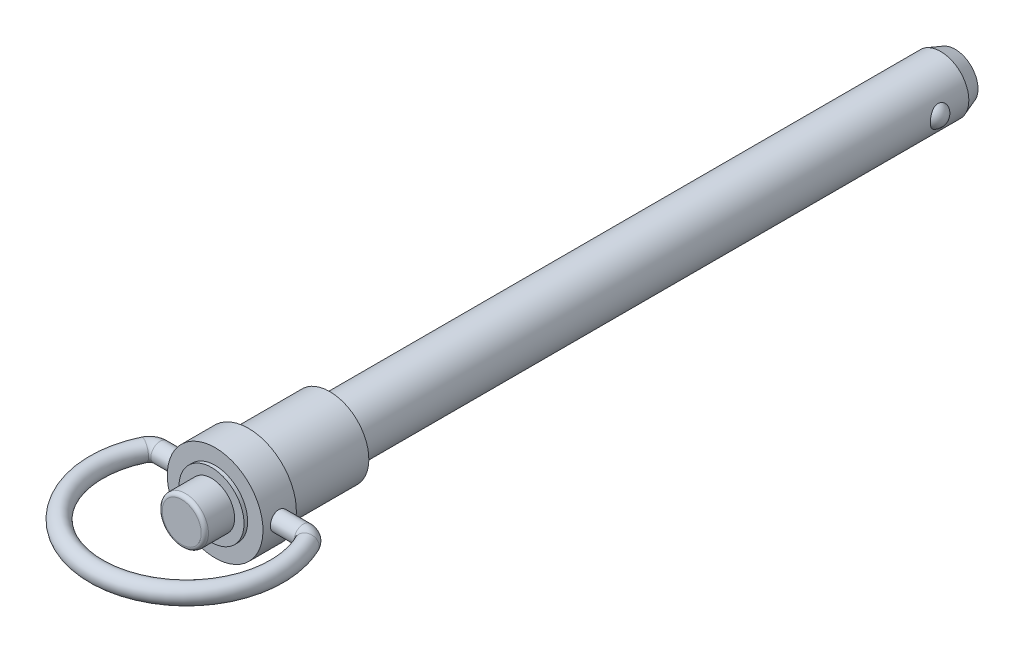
ISO-10303-21;
HEADER;
FILE_DESCRIPTION(('STEP AP214'),'2;1');
FILE_NAME('part.step','',(''),(''),'','','');
FILE_SCHEMA(('AUTOMOTIVE_DESIGN { 1 0 10303 214 1 1 1 1 }'));
ENDSEC;
DATA;
#1=APPLICATION_CONTEXT('core data for automotive mechanical design processes');
#2=APPLICATION_PROTOCOL_DEFINITION('international standard','automotive_design',2000,#1);
#3=PRODUCT_CONTEXT('',#1,'mechanical');
#4=PRODUCT('Part','Part','',(#3));
#5=PRODUCT_RELATED_PRODUCT_CATEGORY('part','',(#4));
#6=PRODUCT_DEFINITION_FORMATION('','',#4);
#7=PRODUCT_DEFINITION_CONTEXT('part definition',#1,'design');
#8=PRODUCT_DEFINITION('design','',#6,#7);
#9=PRODUCT_DEFINITION_SHAPE('','',#8);
#10=(LENGTH_UNIT() NAMED_UNIT(*) SI_UNIT(.MILLI.,.METRE.));
#11=(NAMED_UNIT(*) PLANE_ANGLE_UNIT() SI_UNIT($,.RADIAN.));
#12=(NAMED_UNIT(*) SI_UNIT($,.STERADIAN.) SOLID_ANGLE_UNIT());
#13=UNCERTAINTY_MEASURE_WITH_UNIT(LENGTH_MEASURE(1.E-05),#10,'distance_accuracy_value','');
#14=(GEOMETRIC_REPRESENTATION_CONTEXT(3) GLOBAL_UNCERTAINTY_ASSIGNED_CONTEXT((#13)) GLOBAL_UNIT_ASSIGNED_CONTEXT((#10,
#11,#12)) REPRESENTATION_CONTEXT('',''));
#15=CARTESIAN_POINT('',(0.,0.,0.));
#16=DIRECTION('',(0.,0.,1.));
#17=DIRECTION('',(1.,0.,0.));
#18=AXIS2_PLACEMENT_3D('',#15,#16,#17);
#19=CARTESIAN_POINT('',(0.,0.,20.828));
#20=DIRECTION('',(0.,0.,1.));
#21=DIRECTION('',(0.,-1.,0.));
#22=AXIS2_PLACEMENT_3D('',#19,#20,#21);
#23=PLANE('',#22);
#24=CARTESIAN_POINT('',(0.,0.,20.828));
#25=DIRECTION('',(0.,0.,-1.));
#26=DIRECTION('',(0.,1.,0.));
#27=AXIS2_PLACEMENT_3D('',#24,#25,#26);
#28=CIRCLE('',#27,2.7432);
#29=CARTESIAN_POINT('',(0.,2.7432,20.828));
#30=VERTEX_POINT('',#29);
#31=CARTESIAN_POINT('',(0.,-2.7432,20.828));
#32=VERTEX_POINT('',#31);
#33=EDGE_CURVE('E34',#30,#32,#28,.T.);
#34=ORIENTED_EDGE('',*,*,#33,.F.);
#35=CARTESIAN_POINT('',(0.,0.,20.828));
#36=DIRECTION('',(0.,0.,-1.));
#37=DIRECTION('',(0.,-1.,0.));
#38=AXIS2_PLACEMENT_3D('',#35,#36,#37);
#39=CIRCLE('',#38,2.7432);
#40=EDGE_CURVE('E29',#32,#30,#39,.T.);
#41=ORIENTED_EDGE('',*,*,#40,.F.);
#42=EDGE_LOOP('',(#34,#41));
#43=FACE_BOUND('',#42,.T.);
#44=ADVANCED_FACE('F15',(#43),#23,.T.);
#45=CARTESIAN_POINT('',(0.,0.,20.32));
#46=DIRECTION('',(0.,0.,1.));
#47=DIRECTION('',(0.,-1.,0.));
#48=AXIS2_PLACEMENT_3D('',#45,#46,#47);
#49=TOROIDAL_SURFACE('',#48,2.7432,0.508);
#50=ORIENTED_EDGE('',*,*,#40,.T.);
#51=ORIENTED_EDGE('',*,*,#33,.T.);
#52=EDGE_LOOP('',(#50,#51));
#53=FACE_BOUND('',#52,.T.);
#54=CARTESIAN_POINT('',(0.,0.,20.32));
#55=DIRECTION('',(0.,0.,-1.));
#56=DIRECTION('',(0.,1.,0.));
#57=AXIS2_PLACEMENT_3D('',#54,#55,#56);
#58=CIRCLE('',#57,3.2512);
#59=CARTESIAN_POINT('',(0.,3.2512,20.32));
#60=VERTEX_POINT('',#59);
#61=EDGE_CURVE('E51',#60,#60,#58,.T.);
#62=ORIENTED_EDGE('',*,*,#61,.F.);
#63=EDGE_LOOP('',(#62));
#64=FACE_BOUND('',#63,.T.);
#65=ADVANCED_FACE('F40',(#53,#64),#49,.T.);
#66=CARTESIAN_POINT('',(0.,0.,20.828));
#67=DIRECTION('',(0.,0.,-1.));
#68=DIRECTION('',(0.,1.,0.));
#69=AXIS2_PLACEMENT_3D('',#66,#67,#68);
#70=CYLINDRICAL_SURFACE('',#69,3.2512);
#71=CARTESIAN_POINT('',(0.,0.,16.637));
#72=DIRECTION('',(0.,0.,-1.));
#73=DIRECTION('',(0.,1.,0.));
#74=AXIS2_PLACEMENT_3D('',#71,#72,#73);
#75=CIRCLE('',#74,3.2512);
#76=CARTESIAN_POINT('',(0.,3.2512,16.637));
#77=VERTEX_POINT('',#76);
#78=EDGE_CURVE('E60',#77,#77,#75,.T.);
#79=ORIENTED_EDGE('',*,*,#78,.F.);
#80=EDGE_LOOP('',(#79));
#81=FACE_BOUND('',#80,.T.);
#82=ORIENTED_EDGE('',*,*,#61,.T.);
#83=EDGE_LOOP('',(#82));
#84=FACE_BOUND('',#83,.T.);
#85=ADVANCED_FACE('F80',(#81,#84),#70,.T.);
#86=CARTESIAN_POINT('',(4.572,0.,16.637));
#87=DIRECTION('',(0.,0.,1.));
#88=DIRECTION('',(0.,-1.,0.));
#89=AXIS2_PLACEMENT_3D('',#86,#87,#88);
#90=PLANE('',#89);
#91=ORIENTED_EDGE('',*,*,#78,.T.);
#92=EDGE_LOOP('',(#91));
#93=FACE_BOUND('',#92,.T.);
#94=CARTESIAN_POINT('',(0.,0.,16.637));
#95=DIRECTION('',(0.,0.,-1.));
#96=DIRECTION('',(0.,1.,0.));
#97=AXIS2_PLACEMENT_3D('',#94,#95,#96);
#98=CIRCLE('',#97,4.572);
#99=CARTESIAN_POINT('',(0.,4.572,16.637));
#100=VERTEX_POINT('',#99);
#101=EDGE_CURVE('E64',#100,#100,#98,.T.);
#102=ORIENTED_EDGE('',*,*,#101,.F.);
#103=EDGE_LOOP('',(#102));
#104=FACE_BOUND('',#103,.T.);
#105=ADVANCED_FACE('F83',(#93,#104),#90,.T.);
#106=CARTESIAN_POINT('',(0.,0.,0.));
#107=DIRECTION('',(0.,0.,-1.));
#108=DIRECTION('',(0.,1.,0.));
#109=AXIS2_PLACEMENT_3D('',#106,#107,#108);
#110=CYLINDRICAL_SURFACE('',#109,4.572);
#111=ORIENTED_EDGE('',*,*,#101,.T.);
#112=EDGE_LOOP('',(#111));
#113=FACE_BOUND('',#112,.T.);
#114=CARTESIAN_POINT('',(0.,0.,16.129));
#115=DIRECTION('',(0.,0.,-1.));
#116=DIRECTION('',(0.,1.,0.));
#117=AXIS2_PLACEMENT_3D('',#114,#115,#116);
#118=CIRCLE('',#117,4.572);
#119=CARTESIAN_POINT('',(0.,4.572,16.129));
#120=VERTEX_POINT('',#119);
#121=EDGE_CURVE('E218',#120,#120,#118,.T.);
#122=ORIENTED_EDGE('',*,*,#121,.F.);
#123=EDGE_LOOP('',(#122));
#124=FACE_BOUND('',#123,.T.);
#125=ADVANCED_FACE('F182',(#113,#124),#110,.T.);
#126=CARTESIAN_POINT('',(6.731,0.,16.129));
#127=DIRECTION('',(0.,0.,1.));
#128=DIRECTION('',(0.,-1.,0.));
#129=AXIS2_PLACEMENT_3D('',#126,#127,#128);
#130=PLANE('',#129);
#131=CARTESIAN_POINT('',(0.,0.,16.129));
#132=DIRECTION('',(0.,0.,-1.));
#133=DIRECTION('',(0.,1.,0.));
#134=AXIS2_PLACEMENT_3D('',#131,#132,#133);
#135=CIRCLE('',#134,6.731);
#136=CARTESIAN_POINT('',(0.,6.731,16.129));
#137=VERTEX_POINT('',#136);
#138=EDGE_CURVE('E221',#137,#137,#135,.T.);
#139=ORIENTED_EDGE('',*,*,#138,.F.);
#140=EDGE_LOOP('',(#139));
#141=FACE_BOUND('',#140,.T.);
#142=ORIENTED_EDGE('',*,*,#121,.T.);
#143=EDGE_LOOP('',(#142));
#144=FACE_BOUND('',#143,.T.);
#145=ADVANCED_FACE('F171',(#141,#144),#130,.T.);
#146=CARTESIAN_POINT('',(0.,0.,0.));
#147=DIRECTION('',(0.,0.,-1.));
#148=DIRECTION('',(0.,1.,0.));
#149=AXIS2_PLACEMENT_3D('',#146,#147,#148);
#150=CYLINDRICAL_SURFACE('',#149,6.731);
#151=CARTESIAN_POINT('',(0.,0.,11.43));
#152=DIRECTION('',(0.,0.,-1.));
#153=DIRECTION('',(0.,1.,0.));
#154=AXIS2_PLACEMENT_3D('',#151,#152,#153);
#155=CIRCLE('',#154,6.731);
#156=CARTESIAN_POINT('',(0.,6.731,11.43));
#157=VERTEX_POINT('',#156);
#158=EDGE_CURVE('E223',#157,#157,#155,.T.);
#159=ORIENTED_EDGE('',*,*,#158,.F.);
#160=EDGE_LOOP('',(#159));
#161=FACE_BOUND('',#160,.T.);
#162=ORIENTED_EDGE('',*,*,#138,.T.);
#163=EDGE_LOOP('',(#162));
#164=FACE_BOUND('',#163,.T.);
#165=CARTESIAN_POINT('',(-6.6051722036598,1.2954,13.7922));
#166=CARTESIAN_POINT('',(-6.60517361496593,1.2953972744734,13.864236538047));
#167=CARTESIAN_POINT('',(-6.60636346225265,1.28937073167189,13.9363080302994));
#168=CARTESIAN_POINT('',(-6.61098794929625,1.26544153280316,14.0784162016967));
#169=CARTESIAN_POINT('',(-6.61442445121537,1.24752902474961,14.1484511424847));
#170=CARTESIAN_POINT('',(-6.62313895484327,1.20040052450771,14.2844095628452));
#171=CARTESIAN_POINT('',(-6.62841519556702,1.17119533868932,14.3503369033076));
#172=CARTESIAN_POINT('',(-6.64021258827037,1.10233951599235,14.4763528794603));
#173=CARTESIAN_POINT('',(-6.64673365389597,1.06268960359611,14.5364419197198));
#174=CARTESIAN_POINT('',(-6.66038139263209,0.973516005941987,14.6498669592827));
#175=CARTESIAN_POINT('',(-6.66751428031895,0.9238817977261,14.7031153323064));
#176=CARTESIAN_POINT('',(-6.68152715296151,0.816387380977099,14.8005834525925));
#177=CARTESIAN_POINT('',(-6.6884071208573,0.758526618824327,14.8448025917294));
#178=CARTESIAN_POINT('',(-6.7012057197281,0.635644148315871,14.9232944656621));
#179=CARTESIAN_POINT('',(-6.70711617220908,0.570568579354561,14.9574843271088));
#180=CARTESIAN_POINT('',(-6.71724013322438,0.435464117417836,15.014412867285));
#181=CARTESIAN_POINT('',(-6.72145378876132,0.365435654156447,15.0371525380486));
#182=CARTESIAN_POINT('',(-6.72766549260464,0.223321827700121,15.0702635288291));
#183=CARTESIAN_POINT('',(-6.72968999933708,0.151272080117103,15.0807826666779));
#184=CARTESIAN_POINT('',(-6.73138656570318,0.00640388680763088,15.089614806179));
#185=CARTESIAN_POINT('',(-6.73105883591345,-0.0664144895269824,15.0879289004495));
#186=CARTESIAN_POINT('',(-6.72810846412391,-0.209738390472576,15.072511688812));
#187=CARTESIAN_POINT('',(-6.72551615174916,-0.280261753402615,15.0589395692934));
#188=CARTESIAN_POINT('',(-6.71836197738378,-0.418011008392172,15.0203872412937));
#189=CARTESIAN_POINT('',(-6.71380004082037,-0.485236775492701,14.9954066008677));
#190=CARTESIAN_POINT('',(-6.70316878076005,-0.614941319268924,14.9345963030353));
#191=CARTESIAN_POINT('',(-6.69709072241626,-0.67738974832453,14.8987035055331));
#192=CARTESIAN_POINT('',(-6.68409856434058,-0.795436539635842,14.8171343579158));
#193=CARTESIAN_POINT('',(-6.677184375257,-0.851034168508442,14.7714569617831));
#194=CARTESIAN_POINT('',(-6.66315320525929,-0.954744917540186,14.6707395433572));
#195=CARTESIAN_POINT('',(-6.65603475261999,-1.00272266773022,14.6155602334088));
#196=CARTESIAN_POINT('',(-6.64250376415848,-1.08876420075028,14.4978679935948));
#197=CARTESIAN_POINT('',(-6.63609123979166,-1.12682782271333,14.4353549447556));
#198=CARTESIAN_POINT('',(-6.62469571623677,-1.19200234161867,14.3045844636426));
#199=CARTESIAN_POINT('',(-6.61971540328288,-1.21909269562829,14.2363165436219));
#200=CARTESIAN_POINT('',(-6.61178862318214,-1.26138008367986,14.0960804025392));
#201=CARTESIAN_POINT('',(-6.60884191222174,-1.27657854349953,14.0241126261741));
#202=CARTESIAN_POINT('',(-6.60536444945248,-1.29445125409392,13.8797427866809));
#203=CARTESIAN_POINT('',(-6.60479610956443,-1.29732037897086,13.8073657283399));
#204=CARTESIAN_POINT('',(-6.60603903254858,-1.29097613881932,13.6631669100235));
#205=CARTESIAN_POINT('',(-6.60785017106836,-1.28176340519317,13.5913451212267));
#206=CARTESIAN_POINT('',(-6.6136128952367,-1.25168453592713,13.4509418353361));
#207=CARTESIAN_POINT('',(-6.61754556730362,-1.23092132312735,13.3823374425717));
#208=CARTESIAN_POINT('',(-6.62709183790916,-1.17844042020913,13.249581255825));
#209=CARTESIAN_POINT('',(-6.63270556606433,-1.14672188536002,13.1854298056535));
#210=CARTESIAN_POINT('',(-6.6450665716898,-1.07278507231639,13.0625442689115));
#211=CARTESIAN_POINT('',(-6.65182676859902,-1.03044414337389,13.0038853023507));
#212=CARTESIAN_POINT('',(-6.66568301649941,-0.936629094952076,12.8944341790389));
#213=CARTESIAN_POINT('',(-6.67277909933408,-0.885154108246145,12.8436427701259));
#214=CARTESIAN_POINT('',(-6.68662882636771,-0.773660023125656,12.7506362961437));
#215=CARTESIAN_POINT('',(-6.69337621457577,-0.713530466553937,12.7085525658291));
#216=CARTESIAN_POINT('',(-6.70566168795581,-0.586941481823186,12.6350847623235));
#217=CARTESIAN_POINT('',(-6.71119982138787,-0.520482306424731,12.6037002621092));
#218=CARTESIAN_POINT('',(-6.72041595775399,-0.383476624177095,12.5527164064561));
#219=CARTESIAN_POINT('',(-6.72410395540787,-0.312954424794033,12.5330536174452));
#220=CARTESIAN_POINT('',(-6.72924701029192,-0.169530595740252,12.5058694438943));
#221=CARTESIAN_POINT('',(-6.7307023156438,-0.0966292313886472,12.4983467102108));
#222=CARTESIAN_POINT('',(-6.73121071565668,0.0482259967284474,12.4957052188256));
#223=CARTESIAN_POINT('',(-6.73030215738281,0.120176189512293,12.5003884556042));
#224=CARTESIAN_POINT('',(-6.72626496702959,0.26224403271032,12.5215909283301));
#225=CARTESIAN_POINT('',(-6.72313635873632,0.332361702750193,12.5381100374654));
#226=CARTESIAN_POINT('',(-6.71501101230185,0.468662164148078,12.5824301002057));
#227=CARTESIAN_POINT('',(-6.710017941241,0.534852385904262,12.6102089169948));
#228=CARTESIAN_POINT('',(-6.69870305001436,0.661661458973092,12.6762356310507));
#229=CARTESIAN_POINT('',(-6.69238113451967,0.722279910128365,12.7144842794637));
#230=CARTESIAN_POINT('',(-6.6789853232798,0.837208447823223,12.8010411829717));
#231=CARTESIAN_POINT('',(-6.67190155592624,0.891410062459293,12.8494919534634));
#232=CARTESIAN_POINT('',(-6.65784127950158,0.990982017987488,12.95478313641));
#233=CARTESIAN_POINT('',(-6.65086479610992,1.03635027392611,13.0116255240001));
#234=CARTESIAN_POINT('',(-6.63773378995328,1.11738877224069,13.1327559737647));
#235=CARTESIAN_POINT('',(-6.63158802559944,1.15295925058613,13.1971117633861));
#236=CARTESIAN_POINT('',(-6.62092027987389,1.21272619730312,13.3309847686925));
#237=CARTESIAN_POINT('',(-6.61639678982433,1.23693323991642,13.4004971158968));
#238=CARTESIAN_POINT('',(-6.61041337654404,1.26845390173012,13.5238636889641));
#239=CARTESIAN_POINT('',(-6.60845980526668,1.27854107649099,13.57700269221));
#240=CARTESIAN_POINT('',(-6.60583870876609,1.29201504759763,13.6841545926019));
#241=CARTESIAN_POINT('',(-6.60517114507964,1.29540204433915,13.7381674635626));
#242=CARTESIAN_POINT('',(-6.6051722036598,1.2954,13.7922));
#243=B_SPLINE_CURVE_WITH_KNOTS('',3,(#165,#166,#167,#168,#169,#170,#171,#172,#173,#174,#175,
#176,#177,#178,#179,#180,#181,#182,#183,#184,#185,#186,#187,#188,#189,#190,#191,#192,#193,#194,
#195,#196,#197,#198,#199,#200,#201,#202,#203,#204,#205,#206,#207,#208,#209,#210,#211,#212,#213,
#214,#215,#216,#217,#218,#219,#220,#221,#222,#223,#224,#225,#226,#227,#228,#229,#230,#231,#232,
#233,#234,#235,#236,#237,#238,#239,#240,#241,#242),.UNSPECIFIED.,.T.,.F.,(4,2,2,2,2,2,2,2,2,2,2,
2,2,2,2,2,2,2,2,2,2,2,2,2,2,2,2,2,2,2,2,2,2,2,2,2,2,2,4),(0.,0.215911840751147,
0.432002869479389,0.64788762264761,0.86375740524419,1.08216318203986,1.30058366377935,
1.52076118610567,1.74091962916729,1.95838638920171,2.1758336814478,2.39041258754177,
2.60499961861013,2.82085272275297,3.0367289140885,3.25609136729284,3.47545737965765,
3.69523218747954,3.91498064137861,4.13124273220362,4.34749352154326,4.56184753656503,
4.7762180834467,4.99318797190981,5.21017847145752,5.430235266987,5.65028327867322,
5.86912939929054,6.08795119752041,6.30324544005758,6.51853737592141,6.73340808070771,
6.94829420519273,7.16640910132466,7.38457541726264,7.60488731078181,7.82499378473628,
7.9869478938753,8.14889715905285),.UNSPECIFIED.);
#244=CARTESIAN_POINT('',(-6.6051722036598,1.2954,13.7922));
#245=VERTEX_POINT('',#244);
#246=EDGE_CURVE('E192',#245,#245,#243,.T.);
#247=ORIENTED_EDGE('',*,*,#246,.T.);
#248=EDGE_LOOP('',(#247));
#249=FACE_BOUND('',#248,.T.);
#250=CARTESIAN_POINT('',(6.6051722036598,1.2954,13.7922));
#251=CARTESIAN_POINT('',(6.60517361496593,1.2953972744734,13.720163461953));
#252=CARTESIAN_POINT('',(6.60636346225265,1.2893707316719,13.6480919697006));
#253=CARTESIAN_POINT('',(6.61098794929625,1.26544153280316,13.5059837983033));
#254=CARTESIAN_POINT('',(6.61442445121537,1.24752902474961,13.4359488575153));
#255=CARTESIAN_POINT('',(6.62313895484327,1.20040052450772,13.2999904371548));
#256=CARTESIAN_POINT('',(6.62841519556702,1.17119533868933,13.2340630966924));
#257=CARTESIAN_POINT('',(6.64021258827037,1.10233951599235,13.1080471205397));
#258=CARTESIAN_POINT('',(6.64673365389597,1.06268960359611,13.0479580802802));
#259=CARTESIAN_POINT('',(6.66038139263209,0.973516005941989,12.9345330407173));
#260=CARTESIAN_POINT('',(6.66751428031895,0.923881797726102,12.8812846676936));
#261=CARTESIAN_POINT('',(6.68152715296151,0.816387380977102,12.7838165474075));
#262=CARTESIAN_POINT('',(6.6884071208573,0.758526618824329,12.7395974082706));
#263=CARTESIAN_POINT('',(6.7012057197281,0.635644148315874,12.6611055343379));
#264=CARTESIAN_POINT('',(6.70711617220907,0.570568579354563,12.6269156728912));
#265=CARTESIAN_POINT('',(6.71724013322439,0.435464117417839,12.569987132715));
#266=CARTESIAN_POINT('',(6.72145378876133,0.36543565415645,12.5472474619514));
#267=CARTESIAN_POINT('',(6.72766549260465,0.223321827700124,12.5141364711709));
#268=CARTESIAN_POINT('',(6.72968999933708,0.151272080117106,12.5036173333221));
#269=CARTESIAN_POINT('',(6.73138656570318,0.00640388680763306,12.494785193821));
#270=CARTESIAN_POINT('',(6.73105883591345,-0.0664144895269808,12.4964710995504));
#271=CARTESIAN_POINT('',(6.72810846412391,-0.209738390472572,12.511888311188));
#272=CARTESIAN_POINT('',(6.72551615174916,-0.280261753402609,12.5254604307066));
#273=CARTESIAN_POINT('',(6.71836197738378,-0.418011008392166,12.5640127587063));
#274=CARTESIAN_POINT('',(6.71380004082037,-0.4852367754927,12.5889933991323));
#275=CARTESIAN_POINT('',(6.70316878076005,-0.614941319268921,12.6498036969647));
#276=CARTESIAN_POINT('',(6.69709072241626,-0.67738974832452,12.6856964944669));
#277=CARTESIAN_POINT('',(6.68409856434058,-0.795436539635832,12.7672656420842));
#278=CARTESIAN_POINT('',(6.677184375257,-0.851034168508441,12.8129430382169));
#279=CARTESIAN_POINT('',(6.66315320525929,-0.954744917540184,12.9136604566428));
#280=CARTESIAN_POINT('',(6.65603475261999,-1.00272266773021,12.9688397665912));
#281=CARTESIAN_POINT('',(6.64250376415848,-1.08876420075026,13.0865320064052));
#282=CARTESIAN_POINT('',(6.63609123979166,-1.12682782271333,13.1490450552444));
#283=CARTESIAN_POINT('',(6.62469571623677,-1.19200234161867,13.2798155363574));
#284=CARTESIAN_POINT('',(6.61971540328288,-1.21909269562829,13.3480834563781));
#285=CARTESIAN_POINT('',(6.61178862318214,-1.26138008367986,13.4883195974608));
#286=CARTESIAN_POINT('',(6.60884191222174,-1.27657854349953,13.5602873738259));
#287=CARTESIAN_POINT('',(6.60536444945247,-1.29445125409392,13.7046572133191));
#288=CARTESIAN_POINT('',(6.60479610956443,-1.29732037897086,13.7770342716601));
#289=CARTESIAN_POINT('',(6.60603903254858,-1.29097613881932,13.9212330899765));
#290=CARTESIAN_POINT('',(6.60785017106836,-1.28176340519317,13.9930548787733));
#291=CARTESIAN_POINT('',(6.6136128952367,-1.25168453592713,14.1334581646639));
#292=CARTESIAN_POINT('',(6.61754556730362,-1.23092132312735,14.2020625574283));
#293=CARTESIAN_POINT('',(6.62709183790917,-1.17844042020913,14.334818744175));
#294=CARTESIAN_POINT('',(6.63270556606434,-1.14672188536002,14.3989701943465));
#295=CARTESIAN_POINT('',(6.64506657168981,-1.07278507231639,14.5218557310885));
#296=CARTESIAN_POINT('',(6.65182676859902,-1.03044414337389,14.5805146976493));
#297=CARTESIAN_POINT('',(6.66568301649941,-0.936629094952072,14.6899658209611));
#298=CARTESIAN_POINT('',(6.67277909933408,-0.885154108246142,14.7407572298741));
#299=CARTESIAN_POINT('',(6.68662882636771,-0.773660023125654,14.8337637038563));
#300=CARTESIAN_POINT('',(6.69337621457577,-0.713530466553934,14.8758474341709));
#301=CARTESIAN_POINT('',(6.70566168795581,-0.586941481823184,14.9493152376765));
#302=CARTESIAN_POINT('',(6.71119982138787,-0.520482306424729,14.9806997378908));
#303=CARTESIAN_POINT('',(6.72041595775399,-0.383476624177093,15.0316835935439));
#304=CARTESIAN_POINT('',(6.72410395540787,-0.31295442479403,15.0513463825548));
#305=CARTESIAN_POINT('',(6.72924701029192,-0.169530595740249,15.0785305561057));
#306=CARTESIAN_POINT('',(6.7307023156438,-0.0966292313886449,15.0860532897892));
#307=CARTESIAN_POINT('',(6.73121071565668,0.0482259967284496,15.0886947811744));
#308=CARTESIAN_POINT('',(6.73030215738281,0.120176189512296,15.0840115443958));
#309=CARTESIAN_POINT('',(6.72626496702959,0.262244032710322,15.0628090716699));
#310=CARTESIAN_POINT('',(6.72313635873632,0.332361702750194,15.0462899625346));
#311=CARTESIAN_POINT('',(6.71501101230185,0.46866216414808,15.0019698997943));
#312=CARTESIAN_POINT('',(6.710017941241,0.534852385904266,14.9741910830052));
#313=CARTESIAN_POINT('',(6.69870305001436,0.661661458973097,14.9081643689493));
#314=CARTESIAN_POINT('',(6.69238113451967,0.722279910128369,14.8699157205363));
#315=CARTESIAN_POINT('',(6.6789853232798,0.837208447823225,14.7833588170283));
#316=CARTESIAN_POINT('',(6.67190155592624,0.891410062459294,14.7349080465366));
#317=CARTESIAN_POINT('',(6.65784127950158,0.990982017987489,14.62961686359));
#318=CARTESIAN_POINT('',(6.65086479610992,1.03635027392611,14.5727744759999));
#319=CARTESIAN_POINT('',(6.63773378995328,1.1173887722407,14.4516440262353));
#320=CARTESIAN_POINT('',(6.63158802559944,1.15295925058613,14.3872882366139));
#321=CARTESIAN_POINT('',(6.62092027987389,1.21272619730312,14.2534152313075));
#322=CARTESIAN_POINT('',(6.61639678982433,1.23693323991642,14.1839028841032));
#323=CARTESIAN_POINT('',(6.61041337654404,1.26845390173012,14.0605363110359));
#324=CARTESIAN_POINT('',(6.60845980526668,1.27854107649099,14.00739730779));
#325=CARTESIAN_POINT('',(6.60583870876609,1.29201504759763,13.9002454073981));
#326=CARTESIAN_POINT('',(6.60517114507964,1.29540204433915,13.8462325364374));
#327=CARTESIAN_POINT('',(6.6051722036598,1.2954,13.7922));
#328=B_SPLINE_CURVE_WITH_KNOTS('',3,(#250,#251,#252,#253,#254,#255,#256,#257,#258,#259,#260,
#261,#262,#263,#264,#265,#266,#267,#268,#269,#270,#271,#272,#273,#274,#275,#276,#277,#278,#279,
#280,#281,#282,#283,#284,#285,#286,#287,#288,#289,#290,#291,#292,#293,#294,#295,#296,#297,#298,
#299,#300,#301,#302,#303,#304,#305,#306,#307,#308,#309,#310,#311,#312,#313,#314,#315,#316,#317,
#318,#319,#320,#321,#322,#323,#324,#325,#326,#327),.UNSPECIFIED.,.T.,.F.,(4,2,2,2,2,2,2,2,2,2,2,
2,2,2,2,2,2,2,2,2,2,2,2,2,2,2,2,2,2,2,2,2,2,2,2,2,2,2,4),(0.,0.215911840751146,
0.432002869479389,0.64788762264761,0.86375740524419,1.08216318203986,1.30058366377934,
1.52076118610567,1.74091962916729,1.95838638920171,2.1758336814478,2.39041258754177,
2.60499961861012,2.82085272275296,3.0367289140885,3.25609136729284,3.47545737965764,
3.69523218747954,3.91498064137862,4.13124273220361,4.34749352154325,4.56184753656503,
4.77621808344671,4.99318797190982,5.21017847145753,5.43023526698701,5.65028327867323,
5.86912939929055,6.08795119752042,6.30324544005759,6.51853737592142,6.73340808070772,
6.94829420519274,7.16640910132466,7.38457541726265,7.60488731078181,7.82499378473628,
7.98694789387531,8.14889715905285),.UNSPECIFIED.);
#329=CARTESIAN_POINT('',(6.6051722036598,1.2954,13.7922));
#330=VERTEX_POINT('',#329);
#331=EDGE_CURVE('E199',#330,#330,#328,.T.);
#332=ORIENTED_EDGE('',*,*,#331,.T.);
#333=EDGE_LOOP('',(#332));
#334=FACE_BOUND('',#333,.T.);
#335=ADVANCED_FACE('F165',(#161,#164,#249,#334),#150,.T.);
#336=CARTESIAN_POINT('',(5.7785,0.,11.43));
#337=DIRECTION('',(0.,0.,-1.));
#338=DIRECTION('',(0.,1.,0.));
#339=AXIS2_PLACEMENT_3D('',#336,#337,#338);
#340=PLANE('',#339);
#341=CARTESIAN_POINT('',(0.,0.,11.43));
#342=DIRECTION('',(0.,0.,-1.));
#343=DIRECTION('',(0.,1.,0.));
#344=AXIS2_PLACEMENT_3D('',#341,#342,#343);
#345=CIRCLE('',#344,5.9);
#346=CARTESIAN_POINT('',(0.,5.9,11.43));
#347=VERTEX_POINT('',#346);
#348=EDGE_CURVE('E23',#347,#347,#345,.F.);
#349=ORIENTED_EDGE('',*,*,#348,.T.);
#350=EDGE_LOOP('',(#349));
#351=FACE_BOUND('',#350,.T.);
#352=ORIENTED_EDGE('',*,*,#158,.T.);
#353=EDGE_LOOP('',(#352));
#354=FACE_BOUND('',#353,.T.);
#355=ADVANCED_FACE('F88',(#351,#354),#340,.T.);
#356=CARTESIAN_POINT('',(10.0803124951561,0.,15.3162));
#357=DIRECTION('',(0.,1.,0.));
#358=DIRECTION('',(-1.,0.,0.));
#359=AXIS2_PLACEMENT_3D('',#356,#357,#358);
#360=TOROIDAL_SURFACE('',#359,1.524,1.2954);
#361=CARTESIAN_POINT('',(11.4549005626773,0.,14.658109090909));
#362=DIRECTION('',(-0.431818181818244,0.,-0.901960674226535));
#363=DIRECTION('',(0.901960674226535,0.,-0.431818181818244));
#364=AXIS2_PLACEMENT_3D('',#361,#362,#363);
#365=CIRCLE('',#364,1.2954);
#366=CARTESIAN_POINT('',(12.6233004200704,0.,14.0987318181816));
#367=VERTEX_POINT('',#366);
#368=EDGE_CURVE('E42',#367,#367,#365,.T.);
#369=ORIENTED_EDGE('',*,*,#368,.T.);
#370=EDGE_LOOP('',(#369));
#371=FACE_BOUND('',#370,.T.);
#372=CARTESIAN_POINT('',(10.0803124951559,0.,13.7922));
#373=DIRECTION('',(1.,0.,0.));
#374=DIRECTION('',(0.,1.,0.));
#375=AXIS2_PLACEMENT_3D('',#372,#373,#374);
#376=CIRCLE('',#375,1.2954);
#377=CARTESIAN_POINT('',(10.0803124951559,1.2954,13.7922));
#378=VERTEX_POINT('',#377);
#379=EDGE_CURVE('E57',#378,#378,#376,.F.);
#380=ORIENTED_EDGE('',*,*,#379,.F.);
#381=EDGE_LOOP('',(#380));
#382=FACE_BOUND('',#381,.T.);
#383=ADVANCED_FACE('F85',(#371,#382),#360,.T.);
#384=CARTESIAN_POINT('',(-10.0803124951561,0.,13.7922));
#385=DIRECTION('',(1.,0.,0.));
#386=DIRECTION('',(0.,1.,0.));
#387=AXIS2_PLACEMENT_3D('',#384,#385,#386);
#388=CYLINDRICAL_SURFACE('',#387,1.2954);
#389=ORIENTED_EDGE('',*,*,#331,.F.);
#390=EDGE_LOOP('',(#389));
#391=FACE_BOUND('',#390,.T.);
#392=ORIENTED_EDGE('',*,*,#379,.T.);
#393=EDGE_LOOP('',(#392));
#394=FACE_BOUND('',#393,.T.);
#395=ADVANCED_FACE('F77',(#391,#394),#388,.T.);
#396=CARTESIAN_POINT('',(0.,0.,20.1422));
#397=DIRECTION('',(0.,1.,0.));
#398=DIRECTION('',(-1.,0.,0.));
#399=AXIS2_PLACEMENT_3D('',#396,#397,#398);
#400=TOROIDAL_SURFACE('',#399,12.7,1.2954);
#401=CARTESIAN_POINT('',(-11.4549005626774,0.,14.658109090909));
#402=DIRECTION('',(-0.43181818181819,0.,0.901960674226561));
#403=DIRECTION('',(-0.901960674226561,0.,-0.43181818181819));
#404=AXIS2_PLACEMENT_3D('',#401,#402,#403);
#405=CIRCLE('',#404,1.2954);
#406=CARTESIAN_POINT('',(-12.6233004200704,0.,14.0987318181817));
#407=VERTEX_POINT('',#406);
#408=EDGE_CURVE('E54',#407,#407,#405,.F.);
#409=ORIENTED_EDGE('',*,*,#408,.F.);
#410=EDGE_LOOP('',(#409));
#411=FACE_BOUND('',#410,.T.);
#412=ORIENTED_EDGE('',*,*,#368,.F.);
#413=EDGE_LOOP('',(#412));
#414=FACE_BOUND('',#413,.T.);
#415=ADVANCED_FACE('F75',(#411,#414),#400,.T.);
#416=CARTESIAN_POINT('',(-10.0803124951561,0.,15.3162));
#417=DIRECTION('',(0.,1.,0.));
#418=DIRECTION('',(-1.,0.,0.));
#419=AXIS2_PLACEMENT_3D('',#416,#417,#418);
#420=TOROIDAL_SURFACE('',#419,1.524,1.2954);
#421=CARTESIAN_POINT('',(-10.0803124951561,0.,13.7922));
#422=DIRECTION('',(1.,0.,0.));
#423=DIRECTION('',(0.,1.,0.));
#424=AXIS2_PLACEMENT_3D('',#421,#422,#423);
#425=CIRCLE('',#424,1.2954);
#426=CARTESIAN_POINT('',(-10.0803124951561,1.2954,13.7922));
#427=VERTEX_POINT('',#426);
#428=EDGE_CURVE('E61',#427,#427,#425,.T.);
#429=ORIENTED_EDGE('',*,*,#428,.F.);
#430=EDGE_LOOP('',(#429));
#431=FACE_BOUND('',#430,.T.);
#432=ORIENTED_EDGE('',*,*,#408,.T.);
#433=EDGE_LOOP('',(#432));
#434=FACE_BOUND('',#433,.T.);
#435=ADVANCED_FACE('F70',(#431,#434),#420,.T.);
#436=CARTESIAN_POINT('',(-10.0803124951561,0.,13.7922));
#437=DIRECTION('',(1.,0.,0.));
#438=DIRECTION('',(0.,1.,0.));
#439=AXIS2_PLACEMENT_3D('',#436,#437,#438);
#440=CYLINDRICAL_SURFACE('',#439,1.2954);
#441=ORIENTED_EDGE('',*,*,#246,.F.);
#442=EDGE_LOOP('',(#441));
#443=FACE_BOUND('',#442,.T.);
#444=ORIENTED_EDGE('',*,*,#428,.T.);
#445=EDGE_LOOP('',(#444));
#446=FACE_BOUND('',#445,.T.);
#447=ADVANCED_FACE('F74',(#443,#446),#440,.T.);
#448=CARTESIAN_POINT('',(0.,0.,40.8002094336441));
#449=DIRECTION('',(0.,0.,-1.));
#450=DIRECTION('',(0.,1.,0.));
#451=AXIS2_PLACEMENT_3D('',#448,#449,#450);
#452=CYLINDRICAL_SURFACE('',#451,5.5);
#453=CARTESIAN_POINT('',(0.,0.,11.03));
#454=DIRECTION('',(0.,0.,-1.));
#455=DIRECTION('',(0.,1.,0.));
#456=AXIS2_PLACEMENT_3D('',#453,#454,#455);
#457=CIRCLE('',#456,5.5);
#458=CARTESIAN_POINT('',(0.,5.5,11.03));
#459=VERTEX_POINT('',#458);
#460=EDGE_CURVE('E9',#459,#459,#457,.T.);
#461=ORIENTED_EDGE('',*,*,#460,.T.);
#462=EDGE_LOOP('',(#461));
#463=FACE_BOUND('',#462,.T.);
#464=CARTESIAN_POINT('',(0.,0.,0.));
#465=DIRECTION('',(0.,0.,-1.));
#466=DIRECTION('',(0.,1.,0.));
#467=AXIS2_PLACEMENT_3D('',#464,#465,#466);
#468=CIRCLE('',#467,5.5);
#469=CARTESIAN_POINT('',(0.,5.5,0.));
#470=VERTEX_POINT('',#469);
#471=EDGE_CURVE('E200',#470,#470,#468,.T.);
#472=ORIENTED_EDGE('',*,*,#471,.F.);
#473=EDGE_LOOP('',(#472));
#474=FACE_BOUND('',#473,.T.);
#475=ADVANCED_FACE('F189',(#463,#474),#452,.T.);
#476=CARTESIAN_POINT('',(3.22979748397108,0.,-87.9908));
#477=DIRECTION('',(0.,0.,1.));
#478=DIRECTION('',(0.,-1.,0.));
#479=AXIS2_PLACEMENT_3D('',#476,#477,#478);
#480=PLANE('',#479);
#481=CARTESIAN_POINT('',(0.,0.,-87.9907999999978));
#482=DIRECTION('',(0.,0.,1.));
#483=DIRECTION('',(0.,-1.,0.));
#484=AXIS2_PLACEMENT_3D('',#481,#482,#483);
#485=CIRCLE('',#484,3.22979748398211);
#486=CARTESIAN_POINT('',(0.,-3.22979748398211,-87.9907999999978));
#487=VERTEX_POINT('',#486);
#488=EDGE_CURVE('E120',#487,#487,#485,.T.);
#489=ORIENTED_EDGE('',*,*,#488,.F.);
#490=EDGE_LOOP('',(#489));
#491=FACE_BOUND('',#490,.T.);
#492=ADVANCED_FACE('F131',(#491),#480,.F.);
#493=CARTESIAN_POINT('',(3.12293,0.,-81.8948));
#494=DIRECTION('',(0.,0.,1.));
#495=DIRECTION('',(1.,0.,0.));
#496=AXIS2_PLACEMENT_3D('',#493,#494,#495);
#497=SPHERICAL_SURFACE('',#496,1.5875);
#498=CARTESIAN_POINT('',(3.969385,0.,-80.5517921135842));
#499=CARTESIAN_POINT('',(3.96938133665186,0.0871787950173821,-80.5517940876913));
#500=CARTESIAN_POINT('',(3.96648576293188,0.174428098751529,-80.5584820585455));
#501=CARTESIAN_POINT('',(3.95516905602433,0.346584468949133,-80.5851998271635));
#502=CARTESIAN_POINT('',(3.94674017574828,0.431488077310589,-80.6052483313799));
#503=CARTESIAN_POINT('',(3.92519423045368,0.59647973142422,-80.6585272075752));
#504=CARTESIAN_POINT('',(3.91207555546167,0.676566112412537,-80.6917621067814));
#505=CARTESIAN_POINT('',(3.88253654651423,0.82945224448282,-80.7710588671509));
#506=CARTESIAN_POINT('',(3.86611699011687,0.90225370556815,-80.8171177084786));
#507=CARTESIAN_POINT('',(3.83222363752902,1.03672093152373,-80.9203356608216));
#508=CARTESIAN_POINT('',(3.81477966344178,1.0985904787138,-80.9772380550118));
#509=CARTESIAN_POINT('',(3.78068495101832,1.21073548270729,-81.1017462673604));
#510=CARTESIAN_POINT('',(3.76403384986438,1.26101628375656,-81.1693471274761));
#511=CARTESIAN_POINT('',(3.73507217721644,1.34426479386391,-81.3077911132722));
#512=CARTESIAN_POINT('',(3.72252093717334,1.37829571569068,-81.3779422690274));
#513=CARTESIAN_POINT('',(3.70178973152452,1.43305274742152,-81.5238520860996));
#514=CARTESIAN_POINT('',(3.69360549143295,1.45379187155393,-81.5996051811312));
#515=CARTESIAN_POINT('',(3.68341966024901,1.47939277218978,-81.7454817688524));
#516=CARTESIAN_POINT('',(3.680835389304,1.4857542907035,-81.8153038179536));
#517=CARTESIAN_POINT('',(3.68040725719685,1.48681628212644,-81.9550414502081));
#518=CARTESIAN_POINT('',(3.68256179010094,1.48152070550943,-82.0249569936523));
#519=CARTESIAN_POINT('',(3.69108766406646,1.4601393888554,-82.1588086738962));
#520=CARTESIAN_POINT('',(3.69721728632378,1.4446714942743,-82.2228608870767));
#521=CARTESIAN_POINT('',(3.71278611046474,1.40417367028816,-82.3474287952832));
#522=CARTESIAN_POINT('',(3.72222570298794,1.37914261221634,-82.4079440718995));
#523=CARTESIAN_POINT('',(3.74389633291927,1.3192072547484,-82.5264268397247));
#524=CARTESIAN_POINT('',(3.75622345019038,1.28394990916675,-82.5841973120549));
#525=CARTESIAN_POINT('',(3.78224213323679,1.20514746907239,-82.6934181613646));
#526=CARTESIAN_POINT('',(3.79593412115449,1.1615998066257,-82.7448665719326));
#527=CARTESIAN_POINT('',(3.82484228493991,1.06277839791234,-82.8454045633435));
#528=CARTESIAN_POINT('',(3.84007638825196,1.00677387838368,-82.8937694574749));
#529=CARTESIAN_POINT('',(3.86933265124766,0.887713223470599,-82.9813922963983));
#530=CARTESIAN_POINT('',(3.88335410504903,0.824653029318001,-83.0206449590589));
#531=CARTESIAN_POINT('',(3.90318345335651,0.722863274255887,-83.0740110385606));
#532=CARTESIAN_POINT('',(3.90984058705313,0.686009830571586,-83.0914710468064));
#533=CARTESIAN_POINT('',(3.92226926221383,0.610957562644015,-83.123476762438));
#534=CARTESIAN_POINT('',(3.92804156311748,0.572759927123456,-83.1380249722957));
#535=CARTESIAN_POINT('',(3.94381689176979,0.456514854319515,-83.1772484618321));
#536=CARTESIAN_POINT('',(3.95229851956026,0.376714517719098,-83.1975549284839));
#537=CARTESIAN_POINT('',(3.96199329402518,0.247044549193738,-83.2205332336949));
#538=CARTESIAN_POINT('',(3.96475587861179,0.197910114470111,-83.2270073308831));
#539=CARTESIAN_POINT('',(3.96845279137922,0.0991914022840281,-83.2356452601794));
#540=CARTESIAN_POINT('',(3.96938708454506,0.049607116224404,-83.2378090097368));
#541=CARTESIAN_POINT('',(3.96938133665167,-0.0871787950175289,-83.2378059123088));
#542=CARTESIAN_POINT('',(3.96648576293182,-0.174428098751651,-83.2311179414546));
#543=CARTESIAN_POINT('',(3.95516905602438,-0.346584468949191,-83.2044001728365));
#544=CARTESIAN_POINT('',(3.94674017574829,-0.431488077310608,-83.18435166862));
#545=CARTESIAN_POINT('',(3.92519423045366,-0.596479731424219,-83.1310727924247));
#546=CARTESIAN_POINT('',(3.91207555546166,-0.676566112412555,-83.0978378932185));
#547=CARTESIAN_POINT('',(3.88253654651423,-0.829452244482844,-83.0185411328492));
#548=CARTESIAN_POINT('',(3.86611699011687,-0.902253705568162,-82.9724822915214));
#549=CARTESIAN_POINT('',(3.83222363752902,-1.03672093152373,-82.8692643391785));
#550=CARTESIAN_POINT('',(3.81477966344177,-1.0985904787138,-82.8123619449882));
#551=CARTESIAN_POINT('',(3.78068495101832,-1.21073548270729,-82.6878537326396));
#552=CARTESIAN_POINT('',(3.76403384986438,-1.26101628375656,-82.6202528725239));
#553=CARTESIAN_POINT('',(3.73507217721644,-1.34426479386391,-82.4818088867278));
#554=CARTESIAN_POINT('',(3.72252093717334,-1.37829571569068,-82.4116577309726));
#555=CARTESIAN_POINT('',(3.70178973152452,-1.43305274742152,-82.2657479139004));
#556=CARTESIAN_POINT('',(3.69360549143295,-1.45379187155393,-82.1899948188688));
#557=CARTESIAN_POINT('',(3.68341966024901,-1.47939277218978,-82.0441182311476));
#558=CARTESIAN_POINT('',(3.680835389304,-1.4857542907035,-81.9742961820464));
#559=CARTESIAN_POINT('',(3.68040725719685,-1.48681628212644,-81.8345585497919));
#560=CARTESIAN_POINT('',(3.68256179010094,-1.48152070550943,-81.7646430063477));
#561=CARTESIAN_POINT('',(3.69108766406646,-1.4601393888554,-81.6307913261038));
#562=CARTESIAN_POINT('',(3.69721728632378,-1.44467149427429,-81.5667391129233));
#563=CARTESIAN_POINT('',(3.71278611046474,-1.40417367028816,-81.4421712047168));
#564=CARTESIAN_POINT('',(3.72222570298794,-1.37914261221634,-81.3816559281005));
#565=CARTESIAN_POINT('',(3.74389633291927,-1.3192072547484,-81.2631731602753));
#566=CARTESIAN_POINT('',(3.75622345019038,-1.28394990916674,-81.2054026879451));
#567=CARTESIAN_POINT('',(3.7822421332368,-1.20514746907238,-81.0961818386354));
#568=CARTESIAN_POINT('',(3.7959341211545,-1.1615998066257,-81.0447334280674));
#569=CARTESIAN_POINT('',(3.82484228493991,-1.06277839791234,-80.9441954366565));
#570=CARTESIAN_POINT('',(3.84007638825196,-1.00677387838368,-80.8958305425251));
#571=CARTESIAN_POINT('',(3.86933265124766,-0.8877132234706,-80.8082077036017));
#572=CARTESIAN_POINT('',(3.88335410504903,-0.824653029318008,-80.7689550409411));
#573=CARTESIAN_POINT('',(3.90318345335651,-0.722863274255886,-80.7155889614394));
#574=CARTESIAN_POINT('',(3.90984058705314,-0.686009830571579,-80.6981289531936));
#575=CARTESIAN_POINT('',(3.92226926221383,-0.610957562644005,-80.666123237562));
#576=CARTESIAN_POINT('',(3.92804156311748,-0.572759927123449,-80.6515750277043));
#577=CARTESIAN_POINT('',(3.94381689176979,-0.456514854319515,-80.6123515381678));
#578=CARTESIAN_POINT('',(3.95229851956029,-0.376714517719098,-80.5920450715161));
#579=CARTESIAN_POINT('',(3.96199329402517,-0.247044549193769,-80.5690667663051));
#580=CARTESIAN_POINT('',(3.96475587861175,-0.197910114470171,-80.5625926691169));
#581=CARTESIAN_POINT('',(3.96845279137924,-0.0991914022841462,-80.5539547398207));
#582=CARTESIAN_POINT('',(3.96938708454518,-0.0496071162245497,-80.5517909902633));
#583=CARTESIAN_POINT('',(3.969385,0.,-80.5517921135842));
#584=B_SPLINE_CURVE_WITH_KNOTS('',3,(#498,#499,#500,#501,#502,#503,#504,#505,#506,#507,#508,
#509,#510,#511,#512,#513,#514,#515,#516,#517,#518,#519,#520,#521,#522,#523,#524,#525,#526,#527,
#528,#529,#530,#531,#532,#533,#534,#535,#536,#537,#538,#539,#540,#541,#542,#543,#544,#545,#546,
#547,#548,#549,#550,#551,#552,#553,#554,#555,#556,#557,#558,#559,#560,#561,#562,#563,#564,#565,
#566,#567,#568,#569,#570,#571,#572,#573,#574,#575,#576,#577,#578,#579,#580,#581,#582,#583),
.UNSPECIFIED.,.T.,.F.,(4,2,2,2,2,2,2,2,2,2,2,2,2,2,2,2,2,2,2,2,2,2,2,2,2,2,2,2,2,2,2,2,2,2,2,2,
2,2,2,2,2,2,4),(0.,0.261355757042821,0.523078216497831,0.784890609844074,1.04664140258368,
1.30282923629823,1.55889868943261,1.79448362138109,2.02983753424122,2.23921556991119,
2.44852266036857,2.64616391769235,2.84382850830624,3.04935366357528,3.25494258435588,
3.48066948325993,3.70652690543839,3.83036514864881,3.95409650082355,4.20121716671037,
4.34993288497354,4.49865145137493,4.76000720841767,5.02172966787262,5.28354206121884,
5.54529285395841,5.80148068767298,6.05755014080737,6.29313507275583,6.52848898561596,
6.73786702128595,6.94717411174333,7.14481536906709,7.34247995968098,7.54800511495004,
7.75359403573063,7.97932093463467,8.20517835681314,8.32901660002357,8.45274795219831,
8.69986861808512,8.8485843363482,8.99730290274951),.UNSPECIFIED.);
#585=CARTESIAN_POINT('',(3.969385,0.,-80.5517921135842));
#586=VERTEX_POINT('',#585);
#587=EDGE_CURVE('E136',#586,#586,#584,.T.);
#588=ORIENTED_EDGE('',*,*,#587,.F.);
#589=EDGE_LOOP('',(#588));
#590=FACE_BOUND('',#589,.T.);
#591=ADVANCED_FACE('F126',(#590),#497,.T.);
#592=CARTESIAN_POINT('',(-3.12207,0.,-81.8948));
#593=DIRECTION('',(0.,0.,1.));
#594=DIRECTION('',(1.,0.,0.));
#595=AXIS2_PLACEMENT_3D('',#592,#593,#594);
#596=SPHERICAL_SURFACE('',#595,1.5875);
#597=CARTESIAN_POINT('',(-3.969385,0.,-83.2372654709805));
#598=CARTESIAN_POINT('',(-3.96938133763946,0.0871655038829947,-83.2372634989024));
#599=CARTESIAN_POINT('',(-3.96648664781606,0.174401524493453,-83.2305767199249));
#600=CARTESIAN_POINT('',(-3.95517337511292,0.346531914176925,-83.2038635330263));
#601=CARTESIAN_POINT('',(-3.94674704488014,0.431422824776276,-83.1838184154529));
#602=CARTESIAN_POINT('',(-3.92520757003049,0.596390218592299,-83.130547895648));
#603=CARTESIAN_POINT('',(-3.91209280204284,0.676465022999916,-83.0973179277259));
#604=CARTESIAN_POINT('',(-3.88256269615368,0.829328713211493,-83.0180318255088));
#605=CARTESIAN_POINT('',(-3.86614813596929,0.902119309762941,-82.9719787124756));
#606=CARTESIAN_POINT('',(-3.83226668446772,1.03656073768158,-82.8687753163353));
#607=CARTESIAN_POINT('',(-3.81482968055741,1.09841593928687,-82.8118824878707));
#608=CARTESIAN_POINT('',(-3.78074977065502,1.21053228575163,-82.6873942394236));
#609=CARTESIAN_POINT('',(-3.76410650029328,1.26079879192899,-82.6198037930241));
#610=CARTESIAN_POINT('',(-3.73516296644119,1.34401179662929,-82.4813917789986));
#611=CARTESIAN_POINT('',(-3.72262152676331,1.37802358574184,-82.4112633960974));
#612=CARTESIAN_POINT('',(-3.70190880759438,1.43274470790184,-82.2654021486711));
#613=CARTESIAN_POINT('',(-3.69373324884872,1.45346707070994,-82.1896748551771));
#614=CARTESIAN_POINT('',(-3.68356253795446,1.47903682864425,-82.0438593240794));
#615=CARTESIAN_POINT('',(-3.6809843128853,1.48538528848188,-81.974072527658));
#616=CARTESIAN_POINT('',(-3.68056466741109,1.48642656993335,-81.8344074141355));
#617=CARTESIAN_POINT('',(-3.68272164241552,1.48112333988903,-81.764529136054));
#618=CARTESIAN_POINT('',(-3.69124841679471,1.45973298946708,-81.6307514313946));
#619=CARTESIAN_POINT('',(-3.69737666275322,1.44426351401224,-81.5667358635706));
#620=CARTESIAN_POINT('',(-3.71293936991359,1.40376833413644,-81.442240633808));
#621=CARTESIAN_POINT('',(-3.7223742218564,1.37874150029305,-81.3817613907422));
#622=CARTESIAN_POINT('',(-3.74403310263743,1.31881886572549,-81.2633463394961));
#623=CARTESIAN_POINT('',(-3.75635326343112,1.28356966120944,-81.2056078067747));
#624=CARTESIAN_POINT('',(-3.78235625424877,1.20478881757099,-81.0964482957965));
#625=CARTESIAN_POINT('',(-3.79603950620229,1.16125461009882,-81.0450292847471));
#626=CARTESIAN_POINT('',(-3.8249299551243,1.06246208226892,-80.9445443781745));
#627=CARTESIAN_POINT('',(-3.84015502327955,1.00647273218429,-80.8962035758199));
#628=CARTESIAN_POINT('',(-3.86939345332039,0.887446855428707,-80.8086250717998));
#629=CARTESIAN_POINT('',(-3.88340610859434,0.824406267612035,-80.7693926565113));
#630=CARTESIAN_POINT('',(-3.90322364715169,0.722645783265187,-80.716052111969));
#631=CARTESIAN_POINT('',(-3.9098772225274,0.685800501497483,-80.6985993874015));
#632=CARTESIAN_POINT('',(-3.92229912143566,0.610765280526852,-80.6666073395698));
#633=CARTESIAN_POINT('',(-3.92806820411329,0.57257652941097,-80.652065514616));
#634=CARTESIAN_POINT('',(-3.94383454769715,0.456359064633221,-80.6128596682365));
#635=CARTESIAN_POINT('',(-3.95231106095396,0.376578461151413,-80.5925629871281));
#636=CARTESIAN_POINT('',(-3.96199909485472,0.246947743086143,-80.5695978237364));
#637=CARTESIAN_POINT('',(-3.96475951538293,0.197832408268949,-80.5631279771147));
#638=CARTESIAN_POINT('',(-3.9684535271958,0.0991523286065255,-80.554495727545));
#639=CARTESIAN_POINT('',(-3.96938708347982,0.0495875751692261,-80.5523334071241));
#640=CARTESIAN_POINT('',(-3.96938133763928,-0.0871655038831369,-80.5523365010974));
#641=CARTESIAN_POINT('',(-3.96648664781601,-0.174401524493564,-80.5590232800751));
#642=CARTESIAN_POINT('',(-3.95517337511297,-0.34653191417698,-80.5857364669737));
#643=CARTESIAN_POINT('',(-3.94674704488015,-0.431422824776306,-80.6057815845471));
#644=CARTESIAN_POINT('',(-3.92520757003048,-0.596390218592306,-80.659052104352));
#645=CARTESIAN_POINT('',(-3.91209280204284,-0.676465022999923,-80.6922820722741));
#646=CARTESIAN_POINT('',(-3.88256269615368,-0.829328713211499,-80.7715681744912));
#647=CARTESIAN_POINT('',(-3.86614813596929,-0.902119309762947,-80.8176212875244));
#648=CARTESIAN_POINT('',(-3.83226668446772,-1.03656073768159,-80.9208246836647));
#649=CARTESIAN_POINT('',(-3.81482968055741,-1.09841593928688,-80.9777175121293));
#650=CARTESIAN_POINT('',(-3.78074977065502,-1.21053228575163,-81.1022057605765));
#651=CARTESIAN_POINT('',(-3.76410650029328,-1.260798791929,-81.1697962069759));
#652=CARTESIAN_POINT('',(-3.73516296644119,-1.3440117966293,-81.3082082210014));
#653=CARTESIAN_POINT('',(-3.72262152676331,-1.37802358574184,-81.3783366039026));
#654=CARTESIAN_POINT('',(-3.70190880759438,-1.43274470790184,-81.5241978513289));
#655=CARTESIAN_POINT('',(-3.69373324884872,-1.45346707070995,-81.5999251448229));
#656=CARTESIAN_POINT('',(-3.68356253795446,-1.47903682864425,-81.7457406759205));
#657=CARTESIAN_POINT('',(-3.68098431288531,-1.48538528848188,-81.815527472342));
#658=CARTESIAN_POINT('',(-3.68056466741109,-1.48642656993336,-81.9551925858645));
#659=CARTESIAN_POINT('',(-3.68272164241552,-1.48112333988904,-82.025070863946));
#660=CARTESIAN_POINT('',(-3.69124841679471,-1.45973298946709,-82.1588485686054));
#661=CARTESIAN_POINT('',(-3.69737666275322,-1.44426351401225,-82.2228641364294));
#662=CARTESIAN_POINT('',(-3.71293936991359,-1.40376833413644,-82.347359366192));
#663=CARTESIAN_POINT('',(-3.7223742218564,-1.37874150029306,-82.4078386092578));
#664=CARTESIAN_POINT('',(-3.74403310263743,-1.31881886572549,-82.5262536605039));
#665=CARTESIAN_POINT('',(-3.75635326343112,-1.28356966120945,-82.5839921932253));
#666=CARTESIAN_POINT('',(-3.78235625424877,-1.204788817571,-82.6931517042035));
#667=CARTESIAN_POINT('',(-3.79603950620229,-1.16125461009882,-82.7445707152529));
#668=CARTESIAN_POINT('',(-3.8249299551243,-1.06246208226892,-82.8450556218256));
#669=CARTESIAN_POINT('',(-3.84015502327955,-1.0064727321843,-82.8933964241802));
#670=CARTESIAN_POINT('',(-3.86939345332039,-0.887446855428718,-82.9809749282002));
#671=CARTESIAN_POINT('',(-3.88340610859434,-0.824406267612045,-83.0202073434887));
#672=CARTESIAN_POINT('',(-3.90322364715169,-0.722645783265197,-83.073547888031));
#673=CARTESIAN_POINT('',(-3.9098772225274,-0.685800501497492,-83.0910006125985));
#674=CARTESIAN_POINT('',(-3.92229912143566,-0.610765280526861,-83.1229926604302));
#675=CARTESIAN_POINT('',(-3.92806820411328,-0.57257652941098,-83.137534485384));
#676=CARTESIAN_POINT('',(-3.94383454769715,-0.456359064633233,-83.1767403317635));
#677=CARTESIAN_POINT('',(-3.95231106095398,-0.376578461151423,-83.1970370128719));
#678=CARTESIAN_POINT('',(-3.96199909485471,-0.246947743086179,-83.2200021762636));
#679=CARTESIAN_POINT('',(-3.96475951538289,-0.197832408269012,-83.2264720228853));
#680=CARTESIAN_POINT('',(-3.96845352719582,-0.0991523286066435,-83.235104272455));
#681=CARTESIAN_POINT('',(-3.96938708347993,-0.0495875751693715,-83.2372665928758));
#682=CARTESIAN_POINT('',(-3.969385,0.,-83.2372654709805));
#683=B_SPLINE_CURVE_WITH_KNOTS('',3,(#597,#598,#599,#600,#601,#602,#603,#604,#605,#606,#607,
#608,#609,#610,#611,#612,#613,#614,#615,#616,#617,#618,#619,#620,#621,#622,#623,#624,#625,#626,
#627,#628,#629,#630,#631,#632,#633,#634,#635,#636,#637,#638,#639,#640,#641,#642,#643,#644,#645,
#646,#647,#648,#649,#650,#651,#652,#653,#654,#655,#656,#657,#658,#659,#660,#661,#662,#663,#664,
#665,#666,#667,#668,#669,#670,#671,#672,#673,#674,#675,#676,#677,#678,#679,#680,#681,#682),
.UNSPECIFIED.,.T.,.F.,(4,2,2,2,2,2,2,2,2,2,2,2,2,2,2,2,2,2,2,2,2,2,2,2,2,2,2,2,2,2,2,2,2,2,2,2,
2,2,2,2,2,2,4),(0.,0.261315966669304,0.522998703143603,0.784772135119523,1.04648394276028,
1.30261745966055,1.55863224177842,1.79412729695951,2.02939110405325,2.23866021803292,
2.44785842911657,2.64539457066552,2.8429540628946,3.04838300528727,3.2538757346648,
3.47951765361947,3.70529020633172,3.8290957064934,3.95279434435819,4.19984978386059,
4.34850695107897,4.49716696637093,4.75848293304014,5.02016566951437,5.28193910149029,
5.54365090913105,5.79978442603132,6.05579920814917,6.29129426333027,6.52655807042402,
6.73582718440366,6.94502539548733,7.14256153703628,7.34012102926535,7.54554997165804,
7.75104270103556,7.97668461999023,8.20245717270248,8.32626267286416,8.44996131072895,
8.69701675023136,8.84567391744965,8.99433393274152),.UNSPECIFIED.);
#684=CARTESIAN_POINT('',(-3.969385,0.,-83.2372654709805));
#685=VERTEX_POINT('',#684);
#686=EDGE_CURVE('E145',#685,#685,#683,.T.);
#687=ORIENTED_EDGE('',*,*,#686,.F.);
#688=EDGE_LOOP('',(#687));
#689=FACE_BOUND('',#688,.T.);
#690=ADVANCED_FACE('F130',(#689),#596,.T.);
#691=CARTESIAN_POINT('',(0.,0.,-85.9587999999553));
#692=DIRECTION('',(0.,0.,1.));
#693=DIRECTION('',(0.,-1.,0.));
#694=AXIS2_PLACEMENT_3D('',#691,#692,#693);
#695=CONICAL_SURFACE('',#694,3.9693850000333,0.349065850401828);
#696=ORIENTED_EDGE('',*,*,#488,.T.);
#697=EDGE_LOOP('',(#696));
#698=FACE_BOUND('',#697,.T.);
#699=CARTESIAN_POINT('',(0.,0.,-85.9588));
#700=DIRECTION('',(0.,0.,1.));
#701=DIRECTION('',(0.,-1.,0.));
#702=AXIS2_PLACEMENT_3D('',#699,#700,#701);
#703=CIRCLE('',#702,3.969385);
#704=CARTESIAN_POINT('',(0.,-3.969385,-85.9588));
#705=VERTEX_POINT('',#704);
#706=EDGE_CURVE('E144',#705,#705,#703,.T.);
#707=ORIENTED_EDGE('',*,*,#706,.F.);
#708=EDGE_LOOP('',(#707));
#709=FACE_BOUND('',#708,.T.);
#710=ADVANCED_FACE('F133',(#698,#709),#695,.T.);
#711=CARTESIAN_POINT('',(0.,0.,-60.));
#712=DIRECTION('',(0.,0.,1.));
#713=DIRECTION('',(-0.810321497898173,-0.585985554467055,0.));
#714=AXIS2_PLACEMENT_3D('',#711,#712,#713);
#715=CYLINDRICAL_SURFACE('',#714,3.969385);
#716=ORIENTED_EDGE('',*,*,#706,.T.);
#717=EDGE_LOOP('',(#716));
#718=FACE_BOUND('',#717,.T.);
#719=ORIENTED_EDGE('',*,*,#686,.T.);
#720=EDGE_LOOP('',(#719));
#721=FACE_BOUND('',#720,.T.);
#722=ORIENTED_EDGE('',*,*,#587,.T.);
#723=EDGE_LOOP('',(#722));
#724=FACE_BOUND('',#723,.T.);
#725=CARTESIAN_POINT('',(0.,0.,0.));
#726=DIRECTION('',(0.,0.,-1.));
#727=DIRECTION('',(0.,1.,0.));
#728=AXIS2_PLACEMENT_3D('',#725,#726,#727);
#729=CIRCLE('',#728,3.969385);
#730=CARTESIAN_POINT('',(0.,3.969385,0.));
#731=VERTEX_POINT('',#730);
#732=EDGE_CURVE('E36',#731,#731,#729,.T.);
#733=ORIENTED_EDGE('',*,*,#732,.T.);
#734=EDGE_LOOP('',(#733));
#735=FACE_BOUND('',#734,.T.);
#736=ADVANCED_FACE('F151',(#718,#721,#724,#735),#715,.T.);
#737=CARTESIAN_POINT('',(0.,0.,0.));
#738=DIRECTION('',(0.,0.,-1.));
#739=DIRECTION('',(0.,1.,0.));
#740=AXIS2_PLACEMENT_3D('',#737,#738,#739);
#741=PLANE('',#740);
#742=ORIENTED_EDGE('',*,*,#732,.F.);
#743=EDGE_LOOP('',(#742));
#744=FACE_BOUND('',#743,.T.);
#745=ORIENTED_EDGE('',*,*,#471,.T.);
#746=EDGE_LOOP('',(#745));
#747=FACE_BOUND('',#746,.T.);
#748=ADVANCED_FACE('F107',(#744,#747),#741,.T.);
#749=CARTESIAN_POINT('',(0.,0.,11.03));
#750=DIRECTION('',(0.,0.,-1.));
#751=DIRECTION('',(0.,1.,0.));
#752=AXIS2_PLACEMENT_3D('',#749,#750,#751);
#753=TOROIDAL_SURFACE('',#752,5.9,0.4);
#754=ORIENTED_EDGE('',*,*,#460,.F.);
#755=EDGE_LOOP('',(#754));
#756=FACE_BOUND('',#755,.T.);
#757=ORIENTED_EDGE('',*,*,#348,.F.);
#758=EDGE_LOOP('',(#757));
#759=FACE_BOUND('',#758,.T.);
#760=ADVANCED_FACE('F17',(#756,#759),#753,.F.);
#761=CLOSED_SHELL('',(#44,#65,#85,#105,#125,#145,#335,#355,#383,#395,#415,#435,#447,#475,#492,
#591,#690,#710,#736,#748,#760));
#762=MANIFOLD_SOLID_BREP('B1',#761);
#763=ADVANCED_BREP_SHAPE_REPRESENTATION('',(#18,#762),#14);
#764=SHAPE_DEFINITION_REPRESENTATION(#9,#763);
ENDSEC;
END-ISO-10303-21;
